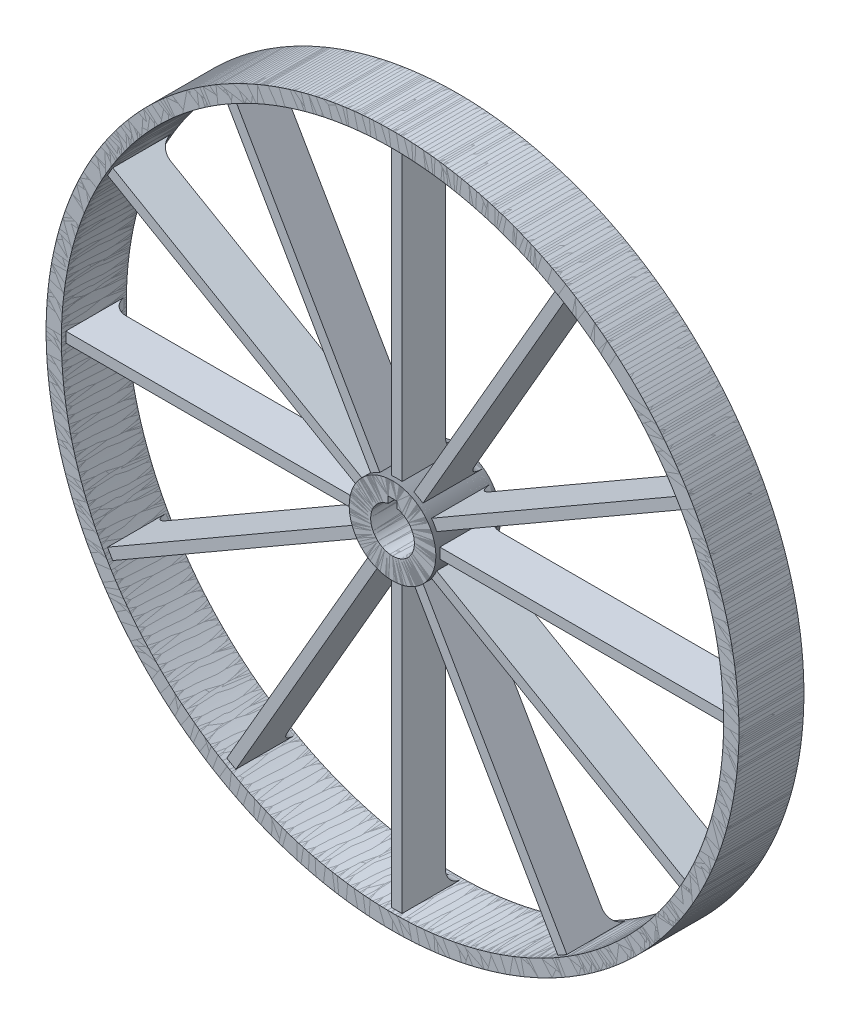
from build123d import *

# Parameters (mm, degrees)
SKETCH_1_R               = 80
SKETCH_1_R_2             = 76.5
EXTRUDE_1_DEPTH          = 15
SKETCH_1_R_3             = 10
SKETCH_1_R_4             = 5.05
EXTRUDE_1_2_DEPTH        = 15
EXTRUDE_2_DEPTH          = 14
CUT_EXTRUDE_1_DEPTH      = 2.4
PATTERN_CIRCULAR_1_COUNT = 12
CUT_EXTRUDE_2_DEPTH      = 125.146896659


with BuildPart() as part:
    # Sketch 1 → Extrude 1 (new body)
    with BuildSketch(Plane.XY):
        with Locations((-11.767184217, 2.257132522)):
            Circle(SKETCH_1_R)
        with Locations((-11.767184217, 2.257132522)):
            Circle(SKETCH_1_R_2, mode=Mode.SUBTRACT)
    extrude(amount=EXTRUDE_1_DEPTH)



with BuildPart() as body_2:
    # Sketch 1 → Extrude 1 2 (new body)
    with BuildSketch(Plane.XY):
        with Locations((-11.767184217, 2.257132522)):
            Circle(SKETCH_1_R_3)
        with Locations((-11.767184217, 2.257132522)):
            Circle(SKETCH_1_R_4, mode=Mode.SUBTRACT)
    extrude(amount=EXTRUDE_1_2_DEPTH)


with BuildPart() as part_1:
    add(part.part)

    add(body_2.part)  # Extrude 2 merges body 2
    # Sketch 1_3 → Extrude 2 (add)
    with BuildSketch(Plane.XY):
        with BuildLine():
            ThreePointArc((-10.567184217, 78.747720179), (-11.767184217, 78.757132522), (-12.967184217, 78.747720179))
            Line((-12.967184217, 78.747720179), (-12.967184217, 12.184871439))
            ThreePointArc((-12.967184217, 12.184871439), (-11.767184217, 12.257132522), (-10.567184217, 12.184871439))
            Line((-10.567184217, 12.184871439), (-10.567184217, 78.747720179))
        make_face()
    extrude(amount=EXTRUDE_2_DEPTH)

    # Sketch 2 → Cut-Extrude 1 (cut)
    with BuildSketch(Plane(origin=(-10.567184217, 0, 0), x_dir=(0, 0, -1), z_dir=(1, 0, 0))):
        with BuildLine():
            Line((0, 12.184871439), (0, 78.747720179))
            ThreePointArc((0, 78.747720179), (-2.828427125, 77.576147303), (-4, 74.747720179))
            Line((-4, 74.747720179), (-4, 16.184871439))
            ThreePointArc((-4, 16.184871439), (-2.828427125, 13.356444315), (0, 12.184871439))
        make_face()
    extrude(amount=-CUT_EXTRUDE_1_DEPTH, mode=Mode.SUBTRACT)


with BuildPart() as pattern_circular_1_1:
    # Pattern Circular 1: pattern copy
    add(part_1.part.rotate(Axis((-11.767184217, 2.257132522, 0), (0, 0, 1)), 1 * 360 / PATTERN_CIRCULAR_1_COUNT))


with BuildPart() as pattern_circular_1_2:
    # Pattern Circular 1: pattern copy
    add(part_1.part.rotate(Axis((-11.767184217, 2.257132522, 0), (0, 0, 1)), 2 * 360 / PATTERN_CIRCULAR_1_COUNT))


with BuildPart() as pattern_circular_1_3:
    # Pattern Circular 1: pattern copy
    add(part_1.part.rotate(Axis((-11.767184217, 2.257132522, 0), (0, 0, 1)), 3 * 360 / PATTERN_CIRCULAR_1_COUNT))


with BuildPart() as pattern_circular_1_4:
    # Pattern Circular 1: pattern copy
    add(part_1.part.rotate(Axis((-11.767184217, 2.257132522, 0), (0, 0, 1)), 4 * 360 / PATTERN_CIRCULAR_1_COUNT))


with BuildPart() as pattern_circular_1_5:
    # Pattern Circular 1: pattern copy
    add(part_1.part.rotate(Axis((-11.767184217, 2.257132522, 0), (0, 0, 1)), 5 * 360 / PATTERN_CIRCULAR_1_COUNT))


with BuildPart() as pattern_circular_1_6:
    # Pattern Circular 1: pattern copy
    add(part_1.part.rotate(Axis((-11.767184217, 2.257132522, 0), (0, 0, 1)), 6 * 360 / PATTERN_CIRCULAR_1_COUNT))


with BuildPart() as pattern_circular_1_7:
    # Pattern Circular 1: pattern copy
    add(part_1.part.rotate(Axis((-11.767184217, 2.257132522, 0), (0, 0, 1)), 7 * 360 / PATTERN_CIRCULAR_1_COUNT))


with BuildPart() as pattern_circular_1_8:
    # Pattern Circular 1: pattern copy
    add(part_1.part.rotate(Axis((-11.767184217, 2.257132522, 0), (0, 0, 1)), 8 * 360 / PATTERN_CIRCULAR_1_COUNT))


with BuildPart() as pattern_circular_1_9:
    # Pattern Circular 1: pattern copy
    add(part_1.part.rotate(Axis((-11.767184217, 2.257132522, 0), (0, 0, 1)), 9 * 360 / PATTERN_CIRCULAR_1_COUNT))


with BuildPart() as pattern_circular_1_10:
    # Pattern Circular 1: pattern copy
    add(part_1.part.rotate(Axis((-11.767184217, 2.257132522, 0), (0, 0, 1)), 10 * 360 / PATTERN_CIRCULAR_1_COUNT))


with BuildPart() as pattern_circular_1_11:
    # Pattern Circular 1: pattern copy
    add(part_1.part.rotate(Axis((-11.767184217, 2.257132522, 0), (0, 0, 1)), 11 * 360 / PATTERN_CIRCULAR_1_COUNT))


with BuildPart() as cut_extrude_2_tool:
    # Sketch 3 → Cut-Extrude 2 (new, through all)
    with BuildSketch(Plane(origin=(0, 0, 0), x_dir=(-1, 0, 0), z_dir=(0, 0, -1))):
        with BuildLine():
            Line((12.767184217, 8.707132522), (10.767184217, 8.707132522))
            Line((10.767184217, 8.707132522), (10.767184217, 7.207132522))
            ThreePointArc((10.767184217, 7.207132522), (11.767184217, 7.307132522), (12.767184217, 7.207132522))
            Line((12.767184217, 7.207132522), (12.767184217, 8.707132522))
        make_face()
    extrude(amount=-CUT_EXTRUDE_2_DEPTH)


with BuildPart() as part_2:
    add(part_1.part)

    # Cut-Extrude 2: cut by cut_extrude_2_tool
    add(cut_extrude_2_tool.part, mode=Mode.SUBTRACT)


with BuildPart() as pattern_circular_1_1_1:
    add(pattern_circular_1_1.part)

    # Cut-Extrude 2: cut by cut_extrude_2_tool
    add(cut_extrude_2_tool.part, mode=Mode.SUBTRACT)


with BuildPart() as pattern_circular_1_2_1:
    add(pattern_circular_1_2.part)

    # Cut-Extrude 2: cut by cut_extrude_2_tool
    add(cut_extrude_2_tool.part, mode=Mode.SUBTRACT)


with BuildPart() as pattern_circular_1_3_1:
    add(pattern_circular_1_3.part)

    # Cut-Extrude 2: cut by cut_extrude_2_tool
    add(cut_extrude_2_tool.part, mode=Mode.SUBTRACT)


with BuildPart() as pattern_circular_1_4_1:
    add(pattern_circular_1_4.part)

    # Cut-Extrude 2: cut by cut_extrude_2_tool
    add(cut_extrude_2_tool.part, mode=Mode.SUBTRACT)


with BuildPart() as pattern_circular_1_5_1:
    add(pattern_circular_1_5.part)

    # Cut-Extrude 2: cut by cut_extrude_2_tool
    add(cut_extrude_2_tool.part, mode=Mode.SUBTRACT)


with BuildPart() as pattern_circular_1_6_1:
    add(pattern_circular_1_6.part)

    # Cut-Extrude 2: cut by cut_extrude_2_tool
    add(cut_extrude_2_tool.part, mode=Mode.SUBTRACT)


with BuildPart() as pattern_circular_1_7_1:
    add(pattern_circular_1_7.part)

    # Cut-Extrude 2: cut by cut_extrude_2_tool
    add(cut_extrude_2_tool.part, mode=Mode.SUBTRACT)


with BuildPart() as pattern_circular_1_8_1:
    add(pattern_circular_1_8.part)

    # Cut-Extrude 2: cut by cut_extrude_2_tool
    add(cut_extrude_2_tool.part, mode=Mode.SUBTRACT)


with BuildPart() as pattern_circular_1_9_1:
    add(pattern_circular_1_9.part)

    # Cut-Extrude 2: cut by cut_extrude_2_tool
    add(cut_extrude_2_tool.part, mode=Mode.SUBTRACT)


with BuildPart() as pattern_circular_1_10_1:
    add(pattern_circular_1_10.part)

    # Cut-Extrude 2: cut by cut_extrude_2_tool
    add(cut_extrude_2_tool.part, mode=Mode.SUBTRACT)


with BuildPart() as pattern_circular_1_11_1:
    add(pattern_circular_1_11.part)

    # Cut-Extrude 2: cut by cut_extrude_2_tool
    add(cut_extrude_2_tool.part, mode=Mode.SUBTRACT)


solid = Compound([part_2.part, pattern_circular_1_1_1.part, pattern_circular_1_2_1.part, pattern_circular_1_3_1.part, pattern_circular_1_4_1.part, pattern_circular_1_5_1.part, pattern_circular_1_6_1.part, pattern_circular_1_7_1.part, pattern_circular_1_8_1.part, pattern_circular_1_9_1.part, pattern_circular_1_10_1.part, pattern_circular_1_11_1.part])
